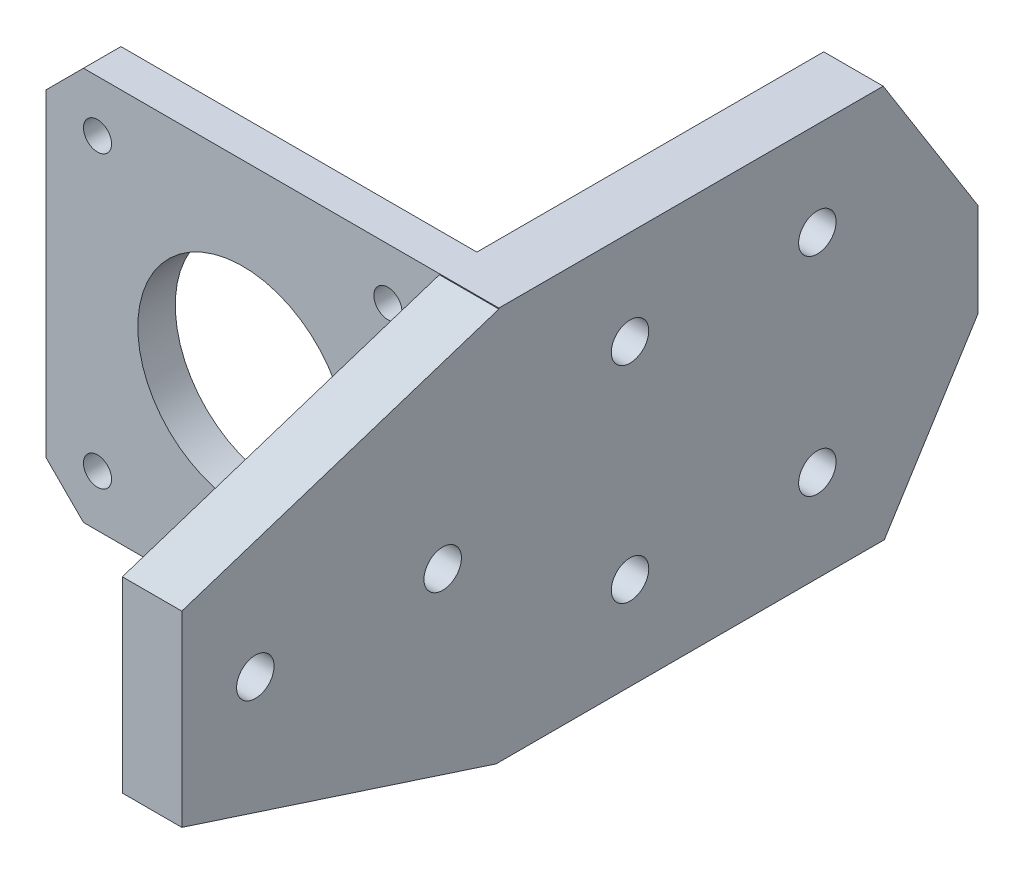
ISO-10303-21;
HEADER;
FILE_DESCRIPTION(('STEP AP214'),'2;1');
FILE_NAME('part.step','',(''),(''),'','','');
FILE_SCHEMA(('AUTOMOTIVE_DESIGN { 1 0 10303 214 1 1 1 1 }'));
ENDSEC;
DATA;
#1=APPLICATION_CONTEXT('core data for automotive mechanical design processes');
#2=APPLICATION_PROTOCOL_DEFINITION('international standard','automotive_design',2000,#1);
#3=PRODUCT_CONTEXT('',#1,'mechanical');
#4=PRODUCT('Part','Part','',(#3));
#5=PRODUCT_RELATED_PRODUCT_CATEGORY('part','',(#4));
#6=PRODUCT_DEFINITION_FORMATION('','',#4);
#7=PRODUCT_DEFINITION_CONTEXT('part definition',#1,'design');
#8=PRODUCT_DEFINITION('design','',#6,#7);
#9=PRODUCT_DEFINITION_SHAPE('','',#8);
#10=(LENGTH_UNIT() NAMED_UNIT(*) SI_UNIT(.MILLI.,.METRE.));
#11=(NAMED_UNIT(*) PLANE_ANGLE_UNIT() SI_UNIT($,.RADIAN.));
#12=(NAMED_UNIT(*) SI_UNIT($,.STERADIAN.) SOLID_ANGLE_UNIT());
#13=UNCERTAINTY_MEASURE_WITH_UNIT(LENGTH_MEASURE(1.E-05),#10,'distance_accuracy_value','');
#14=(GEOMETRIC_REPRESENTATION_CONTEXT(3) GLOBAL_UNCERTAINTY_ASSIGNED_CONTEXT((#13)) GLOBAL_UNIT_ASSIGNED_CONTEXT((#10,
#11,#12)) REPRESENTATION_CONTEXT('',''));
#15=CARTESIAN_POINT('',(0.,0.,0.));
#16=DIRECTION('',(0.,0.,1.));
#17=DIRECTION('',(1.,0.,0.));
#18=AXIS2_PLACEMENT_3D('',#15,#16,#17);
#19=CARTESIAN_POINT('',(0.,0.,37.85));
#20=DIRECTION('',(1.,0.,0.));
#21=DIRECTION('',(0.,0.,-1.));
#22=AXIS2_PLACEMENT_3D('',#19,#20,#21);
#23=PLANE('',#22);
#24=CARTESIAN_POINT('',(0.,31.9056700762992,-29.9999999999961));
#25=DIRECTION('',(-1.,0.,0.));
#26=DIRECTION('',(0.,0.,1.));
#27=AXIS2_PLACEMENT_3D('',#24,#25,#26);
#28=CIRCLE('',#27,2.00000000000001);
#29=CARTESIAN_POINT('',(0.,31.9528350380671,-31.9994437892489));
#30=VERTEX_POINT('',#29);
#31=CARTESIAN_POINT('',(0.,31.952835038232,-28.0005562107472));
#32=VERTEX_POINT('',#31);
#33=EDGE_CURVE('E175',#30,#32,#28,.T.);
#34=ORIENTED_EDGE('',*,*,#33,.T.);
#35=CARTESIAN_POINT('',(0.,32.,-30.));
#36=DIRECTION('',(-1.,0.,0.));
#37=DIRECTION('',(0.,0.,1.));
#38=AXIS2_PLACEMENT_3D('',#35,#36,#37);
#39=CIRCLE('',#38,2.00000000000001);
#40=EDGE_CURVE('E186',#30,#32,#39,.T.);
#41=ORIENTED_EDGE('',*,*,#40,.F.);
#42=EDGE_LOOP('',(#34,#41));
#43=FACE_BOUND('',#42,.T.);
#44=ADVANCED_FACE('F47',(#43),#23,.F.);
#45=CARTESIAN_POINT('',(0.,9.90567007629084,-29.9999999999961));
#46=DIRECTION('',(-1.,0.,0.));
#47=DIRECTION('',(0.,0.,1.));
#48=AXIS2_PLACEMENT_3D('',#45,#46,#47);
#49=CIRCLE('',#48,2.00000000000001);
#50=CARTESIAN_POINT('',(0.,9.85850511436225,-28.0005562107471));
#51=VERTEX_POINT('',#50);
#52=CARTESIAN_POINT('',(0.,9.85850511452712,-31.999443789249));
#53=VERTEX_POINT('',#52);
#54=EDGE_CURVE('E419',#51,#53,#49,.T.);
#55=ORIENTED_EDGE('',*,*,#54,.T.);
#56=CARTESIAN_POINT('',(0.,9.81134015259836,-30.));
#57=DIRECTION('',(-1.,0.,0.));
#58=DIRECTION('',(0.,0.,1.));
#59=AXIS2_PLACEMENT_3D('',#56,#57,#58);
#60=CIRCLE('',#59,2.00000000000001);
#61=EDGE_CURVE('E193',#53,#51,#60,.F.);
#62=ORIENTED_EDGE('',*,*,#61,.T.);
#63=EDGE_LOOP('',(#55,#62));
#64=FACE_BOUND('',#63,.T.);
#65=ADVANCED_FACE('F418',(#64),#23,.F.);
#66=CARTESIAN_POINT('',(85.,9.81134015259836,-30.));
#67=DIRECTION('',(-1.,0.,0.));
#68=DIRECTION('',(0.,0.,1.));
#69=AXIS2_PLACEMENT_3D('',#66,#67,#68);
#70=CYLINDRICAL_SURFACE('',#69,2.00000000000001);
#71=CARTESIAN_POINT('',(6.34999999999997,9.81134015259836,-30.));
#72=DIRECTION('',(1.,0.,0.));
#73=DIRECTION('',(0.,0.,-1.));
#74=AXIS2_PLACEMENT_3D('',#71,#72,#73);
#75=CIRCLE('',#74,2.00000000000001);
#76=CARTESIAN_POINT('',(6.34999999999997,9.81134015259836,-32.));
#77=VERTEX_POINT('',#76);
#78=EDGE_CURVE('E222',#77,#77,#75,.F.);
#79=ORIENTED_EDGE('',*,*,#78,.F.);
#80=EDGE_LOOP('',(#79));
#81=FACE_BOUND('',#80,.T.);
#82=ORIENTED_EDGE('',*,*,#61,.F.);
#83=DIRECTION('',(-1.,0.,0.));
#84=VECTOR('',#83,1.);
#85=CARTESIAN_POINT('',(1.25,9.85850511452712,-31.999443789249));
#86=LINE('',#85,#84);
#87=CARTESIAN_POINT('',(2.5,9.85850511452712,-31.999443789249));
#88=VERTEX_POINT('',#87);
#89=EDGE_CURVE('E11',#53,#88,#86,.F.);
#90=ORIENTED_EDGE('',*,*,#89,.T.);
#91=CARTESIAN_POINT('',(2.5,9.81134015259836,-30.));
#92=DIRECTION('',(-1.,0.,0.));
#93=DIRECTION('',(0.,0.,1.));
#94=AXIS2_PLACEMENT_3D('',#91,#92,#93);
#95=CIRCLE('',#94,2.00000000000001);
#96=CARTESIAN_POINT('',(2.5,9.85850511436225,-28.0005562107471));
#97=VERTEX_POINT('',#96);
#98=EDGE_CURVE('E181',#88,#97,#95,.T.);
#99=ORIENTED_EDGE('',*,*,#98,.T.);
#100=DIRECTION('',(-1.,0.,0.));
#101=VECTOR('',#100,1.);
#102=CARTESIAN_POINT('',(1.25,9.85850511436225,-28.0005562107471));
#103=LINE('',#102,#101);
#104=EDGE_CURVE('E56',#97,#51,#103,.T.);
#105=ORIENTED_EDGE('',*,*,#104,.T.);
#106=EDGE_LOOP('',(#82,#90,#99,#105));
#107=FACE_BOUND('',#106,.T.);
#108=ADVANCED_FACE('F414',(#81,#107),#70,.F.);
#109=CARTESIAN_POINT('',(85.,32.,-30.));
#110=DIRECTION('',(-1.,0.,0.));
#111=DIRECTION('',(0.,0.,1.));
#112=AXIS2_PLACEMENT_3D('',#109,#110,#111);
#113=CYLINDRICAL_SURFACE('',#112,2.00000000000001);
#114=CARTESIAN_POINT('',(6.34999999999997,32.,-30.));
#115=DIRECTION('',(1.,0.,0.));
#116=DIRECTION('',(0.,0.,-1.));
#117=AXIS2_PLACEMENT_3D('',#114,#115,#116);
#118=CIRCLE('',#117,2.00000000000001);
#119=CARTESIAN_POINT('',(6.34999999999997,32.,-32.));
#120=VERTEX_POINT('',#119);
#121=EDGE_CURVE('E374',#120,#120,#118,.T.);
#122=ORIENTED_EDGE('',*,*,#121,.T.);
#123=EDGE_LOOP('',(#122));
#124=FACE_BOUND('',#123,.T.);
#125=DIRECTION('',(-1.,0.,0.));
#126=VECTOR('',#125,1.);
#127=CARTESIAN_POINT('',(1.25,31.952835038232,-28.0005562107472));
#128=LINE('',#127,#126);
#129=CARTESIAN_POINT('',(2.5,31.952835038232,-28.0005562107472));
#130=VERTEX_POINT('',#129);
#131=EDGE_CURVE('E172',#130,#32,#128,.T.);
#132=ORIENTED_EDGE('',*,*,#131,.F.);
#133=CARTESIAN_POINT('',(2.5,32.,-30.));
#134=DIRECTION('',(-1.,0.,0.));
#135=DIRECTION('',(0.,0.,1.));
#136=AXIS2_PLACEMENT_3D('',#133,#134,#135);
#137=CIRCLE('',#136,2.00000000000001);
#138=CARTESIAN_POINT('',(2.5,31.9528350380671,-31.9994437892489));
#139=VERTEX_POINT('',#138);
#140=EDGE_CURVE('E396',#139,#130,#137,.F.);
#141=ORIENTED_EDGE('',*,*,#140,.F.);
#142=DIRECTION('',(-1.,0.,0.));
#143=VECTOR('',#142,1.);
#144=CARTESIAN_POINT('',(1.25,31.9528350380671,-31.9994437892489));
#145=LINE('',#144,#143);
#146=EDGE_CURVE('E182',#30,#139,#145,.F.);
#147=ORIENTED_EDGE('',*,*,#146,.F.);
#148=ORIENTED_EDGE('',*,*,#40,.T.);
#149=EDGE_LOOP('',(#132,#141,#147,#148));
#150=FACE_BOUND('',#149,.T.);
#151=ADVANCED_FACE('F191',(#124,#150),#113,.F.);
#152=CARTESIAN_POINT('',(85.,31.9056700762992,-9.99999999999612));
#153=DIRECTION('',(-1.,0.,0.));
#154=DIRECTION('',(0.,0.,1.));
#155=AXIS2_PLACEMENT_3D('',#152,#153,#154);
#156=CYLINDRICAL_SURFACE('',#155,2.000000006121);
#157=CARTESIAN_POINT('',(6.34999999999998,31.9056700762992,-9.99999999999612));
#158=DIRECTION('',(1.,0.,0.));
#159=DIRECTION('',(0.,0.,-1.));
#160=AXIS2_PLACEMENT_3D('',#157,#158,#159);
#161=CIRCLE('',#160,2.000000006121);
#162=CARTESIAN_POINT('',(6.34999999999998,31.9056700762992,-12.0000000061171));
#163=VERTEX_POINT('',#162);
#164=EDGE_CURVE('E378',#163,#163,#161,.T.);
#165=ORIENTED_EDGE('',*,*,#164,.T.);
#166=EDGE_LOOP('',(#165));
#167=FACE_BOUND('',#166,.T.);
#168=CARTESIAN_POINT('',(2.5,31.9056700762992,-9.99999999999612));
#169=DIRECTION('',(-1.,0.,0.));
#170=DIRECTION('',(0.,0.,1.));
#171=AXIS2_PLACEMENT_3D('',#168,#169,#170);
#172=CIRCLE('',#171,2.);
#173=CARTESIAN_POINT('',(2.5,31.9056700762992,-7.99999999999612));
#174=VERTEX_POINT('',#173);
#175=EDGE_CURVE('E452',#174,#174,#172,.T.);
#176=ORIENTED_EDGE('',*,*,#175,.T.);
#177=EDGE_LOOP('',(#176));
#178=FACE_BOUND('',#177,.T.);
#179=ADVANCED_FACE('F678',(#167,#178),#156,.F.);
#180=CARTESIAN_POINT('',(85.,9.90567007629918,-9.99999999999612));
#181=DIRECTION('',(-1.,0.,0.));
#182=DIRECTION('',(0.,0.,1.));
#183=AXIS2_PLACEMENT_3D('',#180,#181,#182);
#184=CYLINDRICAL_SURFACE('',#183,2.000000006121);
#185=CARTESIAN_POINT('',(6.34999999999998,9.90567007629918,-9.99999999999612));
#186=DIRECTION('',(1.,0.,0.));
#187=DIRECTION('',(0.,0.,-1.));
#188=AXIS2_PLACEMENT_3D('',#185,#186,#187);
#189=CIRCLE('',#188,2.000000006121);
#190=CARTESIAN_POINT('',(6.34999999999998,9.90567007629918,-12.0000000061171));
#191=VERTEX_POINT('',#190);
#192=EDGE_CURVE('E382',#191,#191,#189,.F.);
#193=ORIENTED_EDGE('',*,*,#192,.F.);
#194=EDGE_LOOP('',(#193));
#195=FACE_BOUND('',#194,.T.);
#196=CARTESIAN_POINT('',(2.5,9.90567007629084,-9.99999999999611));
#197=DIRECTION('',(-1.,0.,0.));
#198=DIRECTION('',(0.,0.,1.));
#199=AXIS2_PLACEMENT_3D('',#196,#197,#198);
#200=CIRCLE('',#199,2.);
#201=CARTESIAN_POINT('',(2.5,9.90567007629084,-7.99999999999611));
#202=VERTEX_POINT('',#201);
#203=EDGE_CURVE('E428',#202,#202,#200,.T.);
#204=ORIENTED_EDGE('',*,*,#203,.T.);
#205=EDGE_LOOP('',(#204));
#206=FACE_BOUND('',#205,.T.);
#207=ADVANCED_FACE('F682',(#195,#206),#184,.F.);
#208=CARTESIAN_POINT('',(85.,20.905670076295,10.0000000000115));
#209=DIRECTION('',(-1.,0.,0.));
#210=DIRECTION('',(0.,0.,1.));
#211=AXIS2_PLACEMENT_3D('',#208,#209,#210);
#212=CYLINDRICAL_SURFACE('',#211,2.);
#213=CARTESIAN_POINT('',(6.34999999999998,20.905670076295,10.0000000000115));
#214=DIRECTION('',(1.,0.,0.));
#215=DIRECTION('',(0.,0.,-1.));
#216=AXIS2_PLACEMENT_3D('',#213,#214,#215);
#217=CIRCLE('',#216,2.);
#218=CARTESIAN_POINT('',(6.34999999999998,20.905670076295,8.00000000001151));
#219=VERTEX_POINT('',#218);
#220=EDGE_CURVE('E386',#219,#219,#217,.T.);
#221=ORIENTED_EDGE('',*,*,#220,.T.);
#222=EDGE_LOOP('',(#221));
#223=FACE_BOUND('',#222,.T.);
#224=CARTESIAN_POINT('',(2.5,20.905670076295,10.0000000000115));
#225=DIRECTION('',(-1.,0.,0.));
#226=DIRECTION('',(0.,0.,1.));
#227=AXIS2_PLACEMENT_3D('',#224,#225,#226);
#228=CIRCLE('',#227,2.);
#229=CARTESIAN_POINT('',(2.5,20.905670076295,12.0000000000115));
#230=VERTEX_POINT('',#229);
#231=EDGE_CURVE('E468',#230,#230,#228,.F.);
#232=ORIENTED_EDGE('',*,*,#231,.F.);
#233=EDGE_LOOP('',(#232));
#234=FACE_BOUND('',#233,.T.);
#235=ADVANCED_FACE('F668',(#223,#234),#212,.F.);
#236=CARTESIAN_POINT('',(85.,20.905670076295,30.0000000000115));
#237=DIRECTION('',(-1.,0.,0.));
#238=DIRECTION('',(0.,0.,1.));
#239=AXIS2_PLACEMENT_3D('',#236,#237,#238);
#240=CYLINDRICAL_SURFACE('',#239,2.);
#241=CARTESIAN_POINT('',(6.34999999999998,20.905670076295,30.0000000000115));
#242=DIRECTION('',(1.,0.,0.));
#243=DIRECTION('',(0.,0.,-1.));
#244=AXIS2_PLACEMENT_3D('',#241,#242,#243);
#245=CIRCLE('',#244,2.);
#246=CARTESIAN_POINT('',(6.34999999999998,20.905670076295,28.0000000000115));
#247=VERTEX_POINT('',#246);
#248=EDGE_CURVE('E237',#247,#247,#245,.T.);
#249=ORIENTED_EDGE('',*,*,#248,.T.);
#250=EDGE_LOOP('',(#249));
#251=FACE_BOUND('',#250,.T.);
#252=CARTESIAN_POINT('',(2.5,20.905670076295,30.0000000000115));
#253=DIRECTION('',(-1.,0.,0.));
#254=DIRECTION('',(0.,0.,1.));
#255=AXIS2_PLACEMENT_3D('',#252,#253,#254);
#256=CIRCLE('',#255,2.);
#257=CARTESIAN_POINT('',(2.5,20.905670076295,32.0000000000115));
#258=VERTEX_POINT('',#257);
#259=EDGE_CURVE('E397',#258,#258,#256,.F.);
#260=ORIENTED_EDGE('',*,*,#259,.F.);
#261=EDGE_LOOP('',(#260));
#262=FACE_BOUND('',#261,.T.);
#263=ADVANCED_FACE('F640',(#251,#262),#240,.F.);
#264=CARTESIAN_POINT('',(0.,0.,4.));
#265=DIRECTION('',(0.,1.,0.));
#266=DIRECTION('',(0.,0.,1.));
#267=AXIS2_PLACEMENT_3D('',#264,#265,#266);
#268=PLANE('',#267);
#269=DIRECTION('',(-1.,0.,0.));
#270=VECTOR('',#269,1.);
#271=CARTESIAN_POINT('',(85.,0.,4.29027890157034));
#272=LINE('',#271,#270);
#273=CARTESIAN_POINT('',(6.34999999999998,0.,4.29027890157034));
#274=VERTEX_POINT('',#273);
#275=CARTESIAN_POINT('',(0.,0.,4.29027890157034));
#276=VERTEX_POINT('',#275);
#277=EDGE_CURVE('E203',#274,#276,#272,.T.);
#278=ORIENTED_EDGE('',*,*,#277,.T.);
#279=DIRECTION('',(0.,0.,-1.));
#280=VECTOR('',#279,1.);
#281=CARTESIAN_POINT('',(0.,0.,37.85));
#282=LINE('',#281,#280);
#283=CARTESIAN_POINT('',(0.,0.,4.));
#284=VERTEX_POINT('',#283);
#285=EDGE_CURVE('E246',#276,#284,#282,.T.);
#286=ORIENTED_EDGE('',*,*,#285,.T.);
#287=DIRECTION('',(1.,0.,0.));
#288=VECTOR('',#287,1.);
#289=CARTESIAN_POINT('',(0.,0.,4.));
#290=LINE('',#289,#288);
#291=CARTESIAN_POINT('',(-38.,0.,4.));
#292=VERTEX_POINT('',#291);
#293=EDGE_CURVE('E297',#292,#284,#290,.T.);
#294=ORIENTED_EDGE('',*,*,#293,.F.);
#295=DIRECTION('',(0.,0.,-1.));
#296=VECTOR('',#295,1.);
#297=CARTESIAN_POINT('',(-38.,0.,4.));
#298=LINE('',#297,#296);
#299=CARTESIAN_POINT('',(-38.,0.,0.));
#300=VERTEX_POINT('',#299);
#301=EDGE_CURVE('E301',#292,#300,#298,.T.);
#302=ORIENTED_EDGE('',*,*,#301,.T.);
#303=DIRECTION('',(1.,0.,0.));
#304=VECTOR('',#303,1.);
#305=CARTESIAN_POINT('',(0.,0.,0.));
#306=LINE('',#305,#304);
#307=CARTESIAN_POINT('',(0.,0.,0.));
#308=VERTEX_POINT('',#307);
#309=EDGE_CURVE('E262',#300,#308,#306,.T.);
#310=ORIENTED_EDGE('',*,*,#309,.T.);
#311=CARTESIAN_POINT('',(0.,0.,-37.15));
#312=VERTEX_POINT('',#311);
#313=EDGE_CURVE('E249',#308,#312,#282,.T.);
#314=ORIENTED_EDGE('',*,*,#313,.T.);
#315=DIRECTION('',(-1.,0.,0.));
#316=VECTOR('',#315,1.);
#317=CARTESIAN_POINT('',(85.,0.,-37.15));
#318=LINE('',#317,#316);
#319=CARTESIAN_POINT('',(6.34999999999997,0.,-37.15));
#320=VERTEX_POINT('',#319);
#321=EDGE_CURVE('E401',#320,#312,#318,.T.);
#322=ORIENTED_EDGE('',*,*,#321,.F.);
#323=DIRECTION('',(0.,0.,-1.));
#324=VECTOR('',#323,1.);
#325=CARTESIAN_POINT('',(6.34999999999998,0.,37.85));
#326=LINE('',#325,#324);
#327=EDGE_CURVE('E250',#274,#320,#326,.T.);
#328=ORIENTED_EDGE('',*,*,#327,.F.);
#329=EDGE_LOOP('',(#278,#286,#294,#302,#310,#314,#322,#328));
#330=FACE_BOUND('',#329,.T.);
#331=ADVANCED_FACE('F521',(#330),#268,.F.);
#332=CARTESIAN_POINT('',(0.,20.905670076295,30.0000000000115));
#333=DIRECTION('',(-1.,0.,0.));
#334=DIRECTION('',(0.,0.,1.));
#335=AXIS2_PLACEMENT_3D('',#332,#333,#334);
#336=CIRCLE('',#335,4.7999999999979);
#337=CARTESIAN_POINT('',(0.,20.905670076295,34.8000000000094));
#338=VERTEX_POINT('',#337);
#339=EDGE_CURVE('E457',#338,#338,#336,.T.);
#340=ORIENTED_EDGE('',*,*,#339,.F.);
#341=EDGE_LOOP('',(#340));
#342=FACE_BOUND('',#341,.T.);
#343=CARTESIAN_POINT('',(0.,20.905670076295,10.0000000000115));
#344=DIRECTION('',(-1.,0.,0.));
#345=DIRECTION('',(0.,0.,1.));
#346=AXIS2_PLACEMENT_3D('',#343,#344,#345);
#347=CIRCLE('',#346,4.8);
#348=CARTESIAN_POINT('',(0.,20.905670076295,14.8000000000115));
#349=VERTEX_POINT('',#348);
#350=EDGE_CURVE('E472',#349,#349,#347,.T.);
#351=ORIENTED_EDGE('',*,*,#350,.F.);
#352=EDGE_LOOP('',(#351));
#353=FACE_BOUND('',#352,.T.);
#354=DIRECTION('',(0.,-1.,0.));
#355=VECTOR('',#354,1.);
#356=CARTESIAN_POINT('',(0.,0.,37.85));
#357=LINE('',#356,#355);
#358=CARTESIAN_POINT('',(0.,30.905670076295,37.85));
#359=VERTEX_POINT('',#358);
#360=CARTESIAN_POINT('',(0.,10.905670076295,37.85));
#361=VERTEX_POINT('',#360);
#362=EDGE_CURVE('E227',#359,#361,#357,.T.);
#363=ORIENTED_EDGE('',*,*,#362,.F.);
#364=DIRECTION('',(0.,-0.309054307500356,0.951044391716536));
#365=VECTOR('',#364,1.);
#366=CARTESIAN_POINT('',(0.,39.0787656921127,12.6991557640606));
#367=LINE('',#366,#365);
#368=CARTESIAN_POINT('',(0.,41.9056700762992,4.));
#369=VERTEX_POINT('',#368);
#370=EDGE_CURVE('E489',#369,#359,#367,.T.);
#371=ORIENTED_EDGE('',*,*,#370,.F.);
#372=DIRECTION('',(0.,-1.,0.));
#373=VECTOR('',#372,1.);
#374=CARTESIAN_POINT('',(0.,0.,4.));
#375=LINE('',#374,#373);
#376=EDGE_CURVE('E278',#369,#284,#375,.T.);
#377=ORIENTED_EDGE('',*,*,#376,.T.);
#378=ORIENTED_EDGE('',*,*,#285,.F.);
#379=DIRECTION('',(0.,0.309054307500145,0.951044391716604));
#380=VECTOR('',#379,1.);
#381=CARTESIAN_POINT('',(0.,-1.26101750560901,0.409784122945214));
#382=LINE('',#381,#380);
#383=EDGE_CURVE('E194',#276,#361,#382,.T.);
#384=ORIENTED_EDGE('',*,*,#383,.T.);
#385=EDGE_LOOP('',(#363,#371,#377,#378,#384));
#386=FACE_BOUND('',#385,.T.);
#387=ADVANCED_FACE('F607',(#342,#353,#386),#23,.F.);
#388=CARTESIAN_POINT('',(0.,31.9056700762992,-9.99999999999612));
#389=DIRECTION('',(-1.,0.,0.));
#390=DIRECTION('',(0.,0.,1.));
#391=AXIS2_PLACEMENT_3D('',#388,#389,#390);
#392=CIRCLE('',#391,4.8);
#393=CARTESIAN_POINT('',(0.,31.9056700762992,-5.19999999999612));
#394=VERTEX_POINT('',#393);
#395=EDGE_CURVE('E446',#394,#394,#392,.T.);
#396=ORIENTED_EDGE('',*,*,#395,.F.);
#397=EDGE_LOOP('',(#396));
#398=FACE_BOUND('',#397,.T.);
#399=CARTESIAN_POINT('',(0.,31.9056700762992,-29.9999999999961));
#400=DIRECTION('',(-1.,0.,0.));
#401=DIRECTION('',(0.,0.,1.));
#402=AXIS2_PLACEMENT_3D('',#399,#400,#401);
#403=CIRCLE('',#402,4.8);
#404=CARTESIAN_POINT('',(0.,31.9056700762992,-25.1999999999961));
#405=VERTEX_POINT('',#404);
#406=EDGE_CURVE('E189',#405,#405,#403,.T.);
#407=ORIENTED_EDGE('',*,*,#406,.F.);
#408=EDGE_LOOP('',(#407));
#409=FACE_BOUND('',#408,.T.);
#410=CARTESIAN_POINT('',(0.,9.90567007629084,-29.9999999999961));
#411=DIRECTION('',(-1.,0.,0.));
#412=DIRECTION('',(0.,0.,1.));
#413=AXIS2_PLACEMENT_3D('',#410,#411,#412);
#414=CIRCLE('',#413,4.8);
#415=CARTESIAN_POINT('',(0.,9.90567007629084,-25.1999999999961));
#416=VERTEX_POINT('',#415);
#417=EDGE_CURVE('E422',#416,#416,#414,.T.);
#418=ORIENTED_EDGE('',*,*,#417,.F.);
#419=EDGE_LOOP('',(#418));
#420=FACE_BOUND('',#419,.T.);
#421=CARTESIAN_POINT('',(0.,9.90567007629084,-9.99999999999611));
#422=DIRECTION('',(-1.,0.,0.));
#423=DIRECTION('',(0.,0.,1.));
#424=AXIS2_PLACEMENT_3D('',#421,#422,#423);
#425=CIRCLE('',#424,4.8);
#426=CARTESIAN_POINT('',(0.,9.90567007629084,-5.19999999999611));
#427=VERTEX_POINT('',#426);
#428=EDGE_CURVE('E479',#427,#427,#425,.T.);
#429=ORIENTED_EDGE('',*,*,#428,.F.);
#430=EDGE_LOOP('',(#429));
#431=FACE_BOUND('',#430,.T.);
#432=DIRECTION('',(0.,0.,-1.));
#433=VECTOR('',#432,1.);
#434=CARTESIAN_POINT('',(0.,42.,37.85));
#435=LINE('',#434,#433);
#436=CARTESIAN_POINT('',(0.,42.,0.));
#437=VERTEX_POINT('',#436);
#438=CARTESIAN_POINT('',(0.,42.,-37.0313883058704));
#439=VERTEX_POINT('',#438);
#440=EDGE_CURVE('E241',#437,#439,#435,.T.);
#441=ORIENTED_EDGE('',*,*,#440,.T.);
#442=DIRECTION('',(0.,0.846584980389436,0.532253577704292));
#443=VECTOR('',#442,1.);
#444=CARTESIAN_POINT('',(0.,28.5846078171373,-45.465734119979));
#445=LINE('',#444,#443);
#446=CARTESIAN_POINT('',(0.,25.9056700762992,-47.15));
#447=VERTEX_POINT('',#446);
#448=EDGE_CURVE('E206',#447,#439,#445,.T.);
#449=ORIENTED_EDGE('',*,*,#448,.F.);
#450=DIRECTION('',(0.,-1.,0.));
#451=VECTOR('',#450,1.);
#452=CARTESIAN_POINT('',(0.,0.,-47.15));
#453=LINE('',#452,#451);
#454=CARTESIAN_POINT('',(0.,15.9056700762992,-47.15));
#455=VERTEX_POINT('',#454);
#456=EDGE_CURVE('E228',#447,#455,#453,.T.);
#457=ORIENTED_EDGE('',*,*,#456,.T.);
#458=DIRECTION('',(0.,-0.846584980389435,0.532253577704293));
#459=VECTOR('',#458,1.);
#460=CARTESIAN_POINT('',(0.,-16.7397114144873,-26.6256326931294));
#461=LINE('',#460,#459);
#462=EDGE_CURVE('E482',#455,#312,#461,.T.);
#463=ORIENTED_EDGE('',*,*,#462,.T.);
#464=ORIENTED_EDGE('',*,*,#313,.F.);
#465=DIRECTION('',(0.,-1.,0.));
#466=VECTOR('',#465,1.);
#467=CARTESIAN_POINT('',(0.,0.,0.));
#468=LINE('',#467,#466);
#469=EDGE_CURVE('E321',#437,#308,#468,.T.);
#470=ORIENTED_EDGE('',*,*,#469,.F.);
#471=EDGE_LOOP('',(#441,#449,#457,#463,#464,#470));
#472=FACE_BOUND('',#471,.T.);
#473=ADVANCED_FACE('F509',(#398,#409,#420,#431,#472),#23,.F.);
#474=CARTESIAN_POINT('',(6.34999999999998,0.,37.85));
#475=DIRECTION('',(1.,0.,0.));
#476=DIRECTION('',(0.,0.,-1.));
#477=AXIS2_PLACEMENT_3D('',#474,#475,#476);
#478=PLANE('',#477);
#479=ORIENTED_EDGE('',*,*,#192,.T.);
#480=EDGE_LOOP('',(#479));
#481=FACE_BOUND('',#480,.T.);
#482=ORIENTED_EDGE('',*,*,#78,.T.);
#483=EDGE_LOOP('',(#482));
#484=FACE_BOUND('',#483,.T.);
#485=ORIENTED_EDGE('',*,*,#121,.F.);
#486=EDGE_LOOP('',(#485));
#487=FACE_BOUND('',#486,.T.);
#488=ORIENTED_EDGE('',*,*,#164,.F.);
#489=EDGE_LOOP('',(#488));
#490=FACE_BOUND('',#489,.T.);
#491=ORIENTED_EDGE('',*,*,#220,.F.);
#492=EDGE_LOOP('',(#491));
#493=FACE_BOUND('',#492,.T.);
#494=ORIENTED_EDGE('',*,*,#248,.F.);
#495=EDGE_LOOP('',(#494));
#496=FACE_BOUND('',#495,.T.);
#497=DIRECTION('',(0.,-0.846584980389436,-0.532253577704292));
#498=VECTOR('',#497,1.);
#499=CARTESIAN_POINT('',(6.34999999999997,45.6397377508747,-34.7430611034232));
#500=LINE('',#499,#498);
#501=CARTESIAN_POINT('',(6.34999999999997,42.,-37.0313883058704));
#502=VERTEX_POINT('',#501);
#503=CARTESIAN_POINT('',(6.34999999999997,25.9056700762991,-47.15));
#504=VERTEX_POINT('',#503);
#505=EDGE_CURVE('E212',#502,#504,#500,.T.);
#506=ORIENTED_EDGE('',*,*,#505,.F.);
#507=DIRECTION('',(0.,0.,-1.));
#508=VECTOR('',#507,1.);
#509=CARTESIAN_POINT('',(6.34999999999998,42.,37.85));
#510=LINE('',#509,#508);
#511=CARTESIAN_POINT('',(6.34999999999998,42.,4.));
#512=VERTEX_POINT('',#511);
#513=EDGE_CURVE('E232',#512,#502,#510,.T.);
#514=ORIENTED_EDGE('',*,*,#513,.F.);
#515=DIRECTION('',(0.,1.,0.));
#516=VECTOR('',#515,1.);
#517=CARTESIAN_POINT('',(6.34999999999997,0.,4.));
#518=LINE('',#517,#516);
#519=CARTESIAN_POINT('',(6.34999999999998,41.9056700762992,4.));
#520=VERTEX_POINT('',#519);
#521=EDGE_CURVE('E370',#520,#512,#518,.T.);
#522=ORIENTED_EDGE('',*,*,#521,.F.);
#523=DIRECTION('',(0.,0.309054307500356,-0.951044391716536));
#524=VECTOR('',#523,1.);
#525=CARTESIAN_POINT('',(6.34999999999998,27.9537284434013,46.9339294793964));
#526=LINE('',#525,#524);
#527=CARTESIAN_POINT('',(6.34999999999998,30.905670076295,37.85));
#528=VERTEX_POINT('',#527);
#529=EDGE_CURVE('E219',#528,#520,#526,.T.);
#530=ORIENTED_EDGE('',*,*,#529,.F.);
#531=DIRECTION('',(0.,-1.,0.));
#532=VECTOR('',#531,1.);
#533=CARTESIAN_POINT('',(6.34999999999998,0.,37.85));
#534=LINE('',#533,#532);
#535=CARTESIAN_POINT('',(6.34999999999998,10.9056700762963,37.85));
#536=VERTEX_POINT('',#535);
#537=EDGE_CURVE('E223',#528,#536,#534,.T.);
#538=ORIENTED_EDGE('',*,*,#537,.T.);
#539=DIRECTION('',(0.,-0.309054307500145,-0.951044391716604));
#540=VECTOR('',#539,1.);
#541=CARTESIAN_POINT('',(6.34999999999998,9.86401974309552,34.6445578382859));
#542=LINE('',#541,#540);
#543=EDGE_CURVE('E215',#536,#274,#542,.T.);
#544=ORIENTED_EDGE('',*,*,#543,.T.);
#545=ORIENTED_EDGE('',*,*,#327,.T.);
#546=DIRECTION('',(0.,0.846584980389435,-0.532253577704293));
#547=VECTOR('',#546,1.);
#548=CARTESIAN_POINT('',(6.34999999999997,-33.7948413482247,-15.9029596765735));
#549=LINE('',#548,#547);
#550=CARTESIAN_POINT('',(6.34999999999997,15.9056700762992,-47.15));
#551=VERTEX_POINT('',#550);
#552=EDGE_CURVE('E200',#320,#551,#549,.T.);
#553=ORIENTED_EDGE('',*,*,#552,.T.);
#554=DIRECTION('',(0.,-1.,0.));
#555=VECTOR('',#554,1.);
#556=CARTESIAN_POINT('',(6.34999999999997,0.,-47.15));
#557=LINE('',#556,#555);
#558=EDGE_CURVE('E233',#504,#551,#557,.T.);
#559=ORIENTED_EDGE('',*,*,#558,.F.);
#560=EDGE_LOOP('',(#506,#514,#522,#530,#538,#544,#545,#553,#559));
#561=FACE_BOUND('',#560,.T.);
#562=ADVANCED_FACE('F518',(#481,#484,#487,#490,#493,#496,#561),#478,.T.);
#563=CARTESIAN_POINT('',(0.,0.,37.85));
#564=DIRECTION('',(0.,0.,-1.));
#565=DIRECTION('',(-1.,0.,0.));
#566=AXIS2_PLACEMENT_3D('',#563,#564,#565);
#567=PLANE('',#566);
#568=ORIENTED_EDGE('',*,*,#537,.F.);
#569=DIRECTION('',(-1.,0.,0.));
#570=VECTOR('',#569,1.);
#571=CARTESIAN_POINT('',(0.,30.9056700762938,37.85));
#572=LINE('',#571,#570);
#573=EDGE_CURVE('E366',#528,#359,#572,.T.);
#574=ORIENTED_EDGE('',*,*,#573,.T.);
#575=ORIENTED_EDGE('',*,*,#362,.T.);
#576=DIRECTION('',(-1.,0.,0.));
#577=VECTOR('',#576,1.);
#578=CARTESIAN_POINT('',(0.,10.9056700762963,37.85));
#579=LINE('',#578,#577);
#580=EDGE_CURVE('E363',#536,#361,#579,.T.);
#581=ORIENTED_EDGE('',*,*,#580,.F.);
#582=EDGE_LOOP('',(#568,#574,#575,#581));
#583=FACE_BOUND('',#582,.T.);
#584=ADVANCED_FACE('F602',(#583),#567,.F.);
#585=CARTESIAN_POINT('',(0.,0.,-47.15));
#586=DIRECTION('',(0.,0.,-1.));
#587=DIRECTION('',(-1.,0.,0.));
#588=AXIS2_PLACEMENT_3D('',#585,#586,#587);
#589=PLANE('',#588);
#590=DIRECTION('',(-1.,0.,0.));
#591=VECTOR('',#590,1.);
#592=CARTESIAN_POINT('',(0.,25.9056700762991,-47.15));
#593=LINE('',#592,#591);
#594=EDGE_CURVE('E360',#504,#447,#593,.T.);
#595=ORIENTED_EDGE('',*,*,#594,.F.);
#596=ORIENTED_EDGE('',*,*,#558,.T.);
#597=DIRECTION('',(-1.,0.,0.));
#598=VECTOR('',#597,1.);
#599=CARTESIAN_POINT('',(0.,15.9056700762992,-47.15));
#600=LINE('',#599,#598);
#601=EDGE_CURVE('E356',#551,#455,#600,.T.);
#602=ORIENTED_EDGE('',*,*,#601,.T.);
#603=ORIENTED_EDGE('',*,*,#456,.F.);
#604=EDGE_LOOP('',(#595,#596,#602,#603));
#605=FACE_BOUND('',#604,.T.);
#606=ADVANCED_FACE('F512',(#605),#589,.T.);
#607=CARTESIAN_POINT('',(0.,42.,4.));
#608=DIRECTION('',(0.,1.,0.));
#609=DIRECTION('',(0.,0.,1.));
#610=AXIS2_PLACEMENT_3D('',#607,#608,#609);
#611=PLANE('',#610);
#612=DIRECTION('',(-1.,0.,0.));
#613=VECTOR('',#612,1.);
#614=CARTESIAN_POINT('',(85.,42.,-37.0313883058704));
#615=LINE('',#614,#613);
#616=EDGE_CURVE('E486',#502,#439,#615,.T.);
#617=ORIENTED_EDGE('',*,*,#616,.T.);
#618=ORIENTED_EDGE('',*,*,#440,.F.);
#619=DIRECTION('',(1.,0.,0.));
#620=VECTOR('',#619,1.);
#621=CARTESIAN_POINT('',(0.,42.,0.));
#622=LINE('',#621,#620);
#623=CARTESIAN_POINT('',(-38.,42.,0.));
#624=VERTEX_POINT('',#623);
#625=EDGE_CURVE('E325',#624,#437,#622,.T.);
#626=ORIENTED_EDGE('',*,*,#625,.F.);
#627=DIRECTION('',(0.,0.,-1.));
#628=VECTOR('',#627,1.);
#629=CARTESIAN_POINT('',(-38.,42.,4.));
#630=LINE('',#629,#628);
#631=CARTESIAN_POINT('',(-38.,42.,4.));
#632=VERTEX_POINT('',#631);
#633=EDGE_CURVE('E353',#632,#624,#630,.T.);
#634=ORIENTED_EDGE('',*,*,#633,.F.);
#635=DIRECTION('',(1.,0.,0.));
#636=VECTOR('',#635,1.);
#637=CARTESIAN_POINT('',(0.,42.,4.));
#638=LINE('',#637,#636);
#639=EDGE_CURVE('E282',#632,#512,#638,.T.);
#640=ORIENTED_EDGE('',*,*,#639,.T.);
#641=ORIENTED_EDGE('',*,*,#513,.T.);
#642=EDGE_LOOP('',(#617,#618,#626,#634,#640,#641));
#643=FACE_BOUND('',#642,.T.);
#644=ADVANCED_FACE('F583',(#643),#611,.T.);
#645=CARTESIAN_POINT('',(-40.,40.,4.));
#646=DIRECTION('',(0.707106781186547,-0.707106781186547,0.));
#647=DIRECTION('',(0.707106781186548,0.707106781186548,0.));
#648=AXIS2_PLACEMENT_3D('',#645,#646,#647);
#649=PLANE('',#648);
#650=DIRECTION('',(-0.707106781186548,-0.707106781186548,0.));
#651=VECTOR('',#650,1.);
#652=CARTESIAN_POINT('',(-40.,40.,0.));
#653=LINE('',#652,#651);
#654=CARTESIAN_POINT('',(-42.,38.,0.));
#655=VERTEX_POINT('',#654);
#656=EDGE_CURVE('E328',#624,#655,#653,.T.);
#657=ORIENTED_EDGE('',*,*,#656,.T.);
#658=DIRECTION('',(0.,0.,-1.));
#659=VECTOR('',#658,1.);
#660=CARTESIAN_POINT('',(-42.,38.,4.));
#661=LINE('',#660,#659);
#662=CARTESIAN_POINT('',(-42.,38.,4.));
#663=VERTEX_POINT('',#662);
#664=EDGE_CURVE('E349',#663,#655,#661,.T.);
#665=ORIENTED_EDGE('',*,*,#664,.F.);
#666=DIRECTION('',(-0.707106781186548,-0.707106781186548,0.));
#667=VECTOR('',#666,1.);
#668=CARTESIAN_POINT('',(-40.,40.,4.));
#669=LINE('',#668,#667);
#670=EDGE_CURVE('E285',#632,#663,#669,.T.);
#671=ORIENTED_EDGE('',*,*,#670,.F.);
#672=ORIENTED_EDGE('',*,*,#633,.T.);
#673=EDGE_LOOP('',(#657,#665,#671,#672));
#674=FACE_BOUND('',#673,.T.);
#675=ADVANCED_FACE('F589',(#674),#649,.F.);
#676=CARTESIAN_POINT('',(-42.,0.,4.));
#677=DIRECTION('',(1.,0.,0.));
#678=DIRECTION('',(0.,0.,-1.));
#679=AXIS2_PLACEMENT_3D('',#676,#677,#678);
#680=PLANE('',#679);
#681=DIRECTION('',(0.,-1.,0.));
#682=VECTOR('',#681,1.);
#683=CARTESIAN_POINT('',(-42.,0.,0.));
#684=LINE('',#683,#682);
#685=CARTESIAN_POINT('',(-42.,4.,0.));
#686=VERTEX_POINT('',#685);
#687=EDGE_CURVE('E332',#655,#686,#684,.T.);
#688=ORIENTED_EDGE('',*,*,#687,.T.);
#689=DIRECTION('',(0.,0.,-1.));
#690=VECTOR('',#689,1.);
#691=CARTESIAN_POINT('',(-42.,4.,4.));
#692=LINE('',#691,#690);
#693=CARTESIAN_POINT('',(-42.,4.,4.));
#694=VERTEX_POINT('',#693);
#695=EDGE_CURVE('E345',#694,#686,#692,.T.);
#696=ORIENTED_EDGE('',*,*,#695,.F.);
#697=DIRECTION('',(0.,-1.,0.));
#698=VECTOR('',#697,1.);
#699=CARTESIAN_POINT('',(-42.,0.,4.));
#700=LINE('',#699,#698);
#701=EDGE_CURVE('E289',#663,#694,#700,.T.);
#702=ORIENTED_EDGE('',*,*,#701,.F.);
#703=ORIENTED_EDGE('',*,*,#664,.T.);
#704=EDGE_LOOP('',(#688,#696,#702,#703));
#705=FACE_BOUND('',#704,.T.);
#706=ADVANCED_FACE('F614',(#705),#680,.F.);
#707=CARTESIAN_POINT('',(-19.,-19.,4.));
#708=DIRECTION('',(0.707106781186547,0.707106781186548,0.));
#709=DIRECTION('',(-0.707106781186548,0.707106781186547,0.));
#710=AXIS2_PLACEMENT_3D('',#707,#708,#709);
#711=PLANE('',#710);
#712=DIRECTION('',(0.707106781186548,-0.707106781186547,0.));
#713=VECTOR('',#712,1.);
#714=CARTESIAN_POINT('',(-19.,-19.,0.));
#715=LINE('',#714,#713);
#716=EDGE_CURVE('E336',#686,#300,#715,.T.);
#717=ORIENTED_EDGE('',*,*,#716,.T.);
#718=ORIENTED_EDGE('',*,*,#301,.F.);
#719=DIRECTION('',(0.707106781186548,-0.707106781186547,0.));
#720=VECTOR('',#719,1.);
#721=CARTESIAN_POINT('',(-19.,-19.,4.));
#722=LINE('',#721,#720);
#723=EDGE_CURVE('E293',#694,#292,#722,.T.);
#724=ORIENTED_EDGE('',*,*,#723,.F.);
#725=ORIENTED_EDGE('',*,*,#695,.T.);
#726=EDGE_LOOP('',(#717,#718,#724,#725));
#727=FACE_BOUND('',#726,.T.);
#728=ADVANCED_FACE('F612',(#727),#711,.F.);
#729=CARTESIAN_POINT('',(-36.4999999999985,36.4999999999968,4.));
#730=DIRECTION('',(0.,0.,-1.));
#731=DIRECTION('',(-1.,0.,0.));
#732=AXIS2_PLACEMENT_3D('',#729,#730,#731);
#733=CYLINDRICAL_SURFACE('',#732,1.5);
#734=CARTESIAN_POINT('',(-36.4999999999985,36.4999999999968,4.));
#735=DIRECTION('',(0.,0.,1.));
#736=DIRECTION('',(1.,0.,0.));
#737=AXIS2_PLACEMENT_3D('',#734,#735,#736);
#738=CIRCLE('',#737,1.5);
#739=CARTESIAN_POINT('',(-34.9999999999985,36.4999999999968,4.));
#740=VERTEX_POINT('',#739);
#741=EDGE_CURVE('E274',#740,#740,#738,.T.);
#742=ORIENTED_EDGE('',*,*,#741,.T.);
#743=EDGE_LOOP('',(#742));
#744=FACE_BOUND('',#743,.T.);
#745=CARTESIAN_POINT('',(-36.4999999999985,36.4999999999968,0.));
#746=DIRECTION('',(0.,0.,1.));
#747=DIRECTION('',(1.,0.,0.));
#748=AXIS2_PLACEMENT_3D('',#745,#746,#747);
#749=CIRCLE('',#748,1.5);
#750=CARTESIAN_POINT('',(-34.9999999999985,36.4999999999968,0.));
#751=VERTEX_POINT('',#750);
#752=EDGE_CURVE('E317',#751,#751,#749,.T.);
#753=ORIENTED_EDGE('',*,*,#752,.F.);
#754=EDGE_LOOP('',(#753));
#755=FACE_BOUND('',#754,.T.);
#756=ADVANCED_FACE('F621',(#744,#755),#733,.F.);
#757=CARTESIAN_POINT('',(-5.50000000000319,36.4999999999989,4.));
#758=DIRECTION('',(0.,0.,-1.));
#759=DIRECTION('',(-1.,0.,0.));
#760=AXIS2_PLACEMENT_3D('',#757,#758,#759);
#761=CYLINDRICAL_SURFACE('',#760,1.50000000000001);
#762=CARTESIAN_POINT('',(-5.50000000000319,36.4999999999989,4.));
#763=DIRECTION('',(0.,0.,1.));
#764=DIRECTION('',(1.,0.,0.));
#765=AXIS2_PLACEMENT_3D('',#762,#763,#764);
#766=CIRCLE('',#765,1.50000000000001);
#767=CARTESIAN_POINT('',(-4.00000000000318,36.4999999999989,4.));
#768=VERTEX_POINT('',#767);
#769=EDGE_CURVE('E270',#768,#768,#766,.T.);
#770=ORIENTED_EDGE('',*,*,#769,.T.);
#771=EDGE_LOOP('',(#770));
#772=FACE_BOUND('',#771,.T.);
#773=CARTESIAN_POINT('',(-5.50000000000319,36.4999999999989,0.));
#774=DIRECTION('',(0.,0.,1.));
#775=DIRECTION('',(1.,0.,0.));
#776=AXIS2_PLACEMENT_3D('',#773,#774,#775);
#777=CIRCLE('',#776,1.50000000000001);
#778=CARTESIAN_POINT('',(-4.00000000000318,36.4999999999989,0.));
#779=VERTEX_POINT('',#778);
#780=EDGE_CURVE('E313',#779,#779,#777,.T.);
#781=ORIENTED_EDGE('',*,*,#780,.F.);
#782=EDGE_LOOP('',(#781));
#783=FACE_BOUND('',#782,.T.);
#784=ADVANCED_FACE('F705',(#772,#783),#761,.F.);
#785=CARTESIAN_POINT('',(-5.50000000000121,5.50000000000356,4.));
#786=DIRECTION('',(0.,0.,-1.));
#787=DIRECTION('',(-1.,0.,0.));
#788=AXIS2_PLACEMENT_3D('',#785,#786,#787);
#789=CYLINDRICAL_SURFACE('',#788,1.5);
#790=CARTESIAN_POINT('',(-5.50000000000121,5.50000000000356,4.));
#791=DIRECTION('',(0.,0.,1.));
#792=DIRECTION('',(1.,0.,0.));
#793=AXIS2_PLACEMENT_3D('',#790,#791,#792);
#794=CIRCLE('',#793,1.5);
#795=CARTESIAN_POINT('',(-4.00000000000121,5.50000000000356,4.));
#796=VERTEX_POINT('',#795);
#797=EDGE_CURVE('E266',#796,#796,#794,.T.);
#798=ORIENTED_EDGE('',*,*,#797,.T.);
#799=EDGE_LOOP('',(#798));
#800=FACE_BOUND('',#799,.T.);
#801=CARTESIAN_POINT('',(-5.50000000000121,5.50000000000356,0.));
#802=DIRECTION('',(0.,0.,1.));
#803=DIRECTION('',(1.,0.,0.));
#804=AXIS2_PLACEMENT_3D('',#801,#802,#803);
#805=CIRCLE('',#804,1.5);
#806=CARTESIAN_POINT('',(-4.00000000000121,5.50000000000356,0.));
#807=VERTEX_POINT('',#806);
#808=EDGE_CURVE('E309',#807,#807,#805,.T.);
#809=ORIENTED_EDGE('',*,*,#808,.F.);
#810=EDGE_LOOP('',(#809));
#811=FACE_BOUND('',#810,.T.);
#812=ADVANCED_FACE('F709',(#800,#811),#789,.F.);
#813=CARTESIAN_POINT('',(-36.4999999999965,5.5000000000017,4.));
#814=DIRECTION('',(0.,0.,-1.));
#815=DIRECTION('',(-1.,0.,0.));
#816=AXIS2_PLACEMENT_3D('',#813,#814,#815);
#817=CYLINDRICAL_SURFACE('',#816,1.50000000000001);
#818=CARTESIAN_POINT('',(-36.4999999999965,5.5000000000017,4.));
#819=DIRECTION('',(0.,0.,1.));
#820=DIRECTION('',(1.,0.,0.));
#821=AXIS2_PLACEMENT_3D('',#818,#819,#820);
#822=CIRCLE('',#821,1.50000000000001);
#823=CARTESIAN_POINT('',(-34.9999999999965,5.5000000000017,4.));
#824=VERTEX_POINT('',#823);
#825=EDGE_CURVE('E261',#824,#824,#822,.T.);
#826=ORIENTED_EDGE('',*,*,#825,.T.);
#827=EDGE_LOOP('',(#826));
#828=FACE_BOUND('',#827,.T.);
#829=CARTESIAN_POINT('',(-36.4999999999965,5.5000000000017,0.));
#830=DIRECTION('',(0.,0.,1.));
#831=DIRECTION('',(1.,0.,0.));
#832=AXIS2_PLACEMENT_3D('',#829,#830,#831);
#833=CIRCLE('',#832,1.50000000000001);
#834=CARTESIAN_POINT('',(-34.9999999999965,5.5000000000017,0.));
#835=VERTEX_POINT('',#834);
#836=EDGE_CURVE('E305',#835,#835,#833,.T.);
#837=ORIENTED_EDGE('',*,*,#836,.F.);
#838=EDGE_LOOP('',(#837));
#839=FACE_BOUND('',#838,.T.);
#840=ADVANCED_FACE('F712',(#828,#839),#817,.F.);
#841=CARTESIAN_POINT('',(-21.,21.,4.));
#842=DIRECTION('',(0.,0.,-1.));
#843=DIRECTION('',(-1.,0.,0.));
#844=AXIS2_PLACEMENT_3D('',#841,#842,#843);
#845=CYLINDRICAL_SURFACE('',#844,11.2);
#846=CARTESIAN_POINT('',(-21.,21.,4.));
#847=DIRECTION('',(0.,0.,1.));
#848=DIRECTION('',(1.,0.,0.));
#849=AXIS2_PLACEMENT_3D('',#846,#847,#848);
#850=CIRCLE('',#849,11.2);
#851=CARTESIAN_POINT('',(-9.8,21.,4.));
#852=VERTEX_POINT('',#851);
#853=EDGE_CURVE('E257',#852,#852,#850,.T.);
#854=ORIENTED_EDGE('',*,*,#853,.T.);
#855=EDGE_LOOP('',(#854));
#856=FACE_BOUND('',#855,.T.);
#857=CARTESIAN_POINT('',(-21.,21.,0.));
#858=DIRECTION('',(0.,0.,1.));
#859=DIRECTION('',(1.,0.,0.));
#860=AXIS2_PLACEMENT_3D('',#857,#858,#859);
#861=CIRCLE('',#860,11.2);
#862=CARTESIAN_POINT('',(-9.8,21.,0.));
#863=VERTEX_POINT('',#862);
#864=EDGE_CURVE('E245',#863,#863,#861,.T.);
#865=ORIENTED_EDGE('',*,*,#864,.F.);
#866=EDGE_LOOP('',(#865));
#867=FACE_BOUND('',#866,.T.);
#868=ADVANCED_FACE('F49',(#856,#867),#845,.F.);
#869=CARTESIAN_POINT('',(0.,0.,4.));
#870=DIRECTION('',(0.,0.,1.));
#871=DIRECTION('',(1.,0.,0.));
#872=AXIS2_PLACEMENT_3D('',#869,#870,#871);
#873=PLANE('',#872);
#874=ORIENTED_EDGE('',*,*,#853,.F.);
#875=EDGE_LOOP('',(#874));
#876=FACE_BOUND('',#875,.T.);
#877=ORIENTED_EDGE('',*,*,#825,.F.);
#878=EDGE_LOOP('',(#877));
#879=FACE_BOUND('',#878,.T.);
#880=ORIENTED_EDGE('',*,*,#797,.F.);
#881=EDGE_LOOP('',(#880));
#882=FACE_BOUND('',#881,.T.);
#883=ORIENTED_EDGE('',*,*,#769,.F.);
#884=EDGE_LOOP('',(#883));
#885=FACE_BOUND('',#884,.T.);
#886=ORIENTED_EDGE('',*,*,#741,.F.);
#887=EDGE_LOOP('',(#886));
#888=FACE_BOUND('',#887,.T.);
#889=ORIENTED_EDGE('',*,*,#376,.F.);
#890=DIRECTION('',(-1.,0.,0.));
#891=VECTOR('',#890,1.);
#892=CARTESIAN_POINT('',(85.,41.9056700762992,4.));
#893=LINE('',#892,#891);
#894=EDGE_CURVE('E491',#520,#369,#893,.T.);
#895=ORIENTED_EDGE('',*,*,#894,.F.);
#896=ORIENTED_EDGE('',*,*,#521,.T.);
#897=ORIENTED_EDGE('',*,*,#639,.F.);
#898=ORIENTED_EDGE('',*,*,#670,.T.);
#899=ORIENTED_EDGE('',*,*,#701,.T.);
#900=ORIENTED_EDGE('',*,*,#723,.T.);
#901=ORIENTED_EDGE('',*,*,#293,.T.);
#902=EDGE_LOOP('',(#889,#895,#896,#897,#898,#899,#900,#901));
#903=FACE_BOUND('',#902,.T.);
#904=ADVANCED_FACE('F593',(#876,#879,#882,#885,#888,#903),#873,.T.);
#905=CARTESIAN_POINT('',(0.,0.,0.));
#906=DIRECTION('',(0.,0.,1.));
#907=DIRECTION('',(1.,0.,0.));
#908=AXIS2_PLACEMENT_3D('',#905,#906,#907);
#909=PLANE('',#908);
#910=ORIENTED_EDGE('',*,*,#864,.T.);
#911=EDGE_LOOP('',(#910));
#912=FACE_BOUND('',#911,.T.);
#913=ORIENTED_EDGE('',*,*,#836,.T.);
#914=EDGE_LOOP('',(#913));
#915=FACE_BOUND('',#914,.T.);
#916=ORIENTED_EDGE('',*,*,#808,.T.);
#917=EDGE_LOOP('',(#916));
#918=FACE_BOUND('',#917,.T.);
#919=ORIENTED_EDGE('',*,*,#780,.T.);
#920=EDGE_LOOP('',(#919));
#921=FACE_BOUND('',#920,.T.);
#922=ORIENTED_EDGE('',*,*,#752,.T.);
#923=EDGE_LOOP('',(#922));
#924=FACE_BOUND('',#923,.T.);
#925=ORIENTED_EDGE('',*,*,#469,.T.);
#926=ORIENTED_EDGE('',*,*,#309,.F.);
#927=ORIENTED_EDGE('',*,*,#716,.F.);
#928=ORIENTED_EDGE('',*,*,#687,.F.);
#929=ORIENTED_EDGE('',*,*,#656,.F.);
#930=ORIENTED_EDGE('',*,*,#625,.T.);
#931=EDGE_LOOP('',(#925,#926,#927,#928,#929,#930));
#932=FACE_BOUND('',#931,.T.);
#933=ADVANCED_FACE('F586',(#912,#915,#918,#921,#924,#932),#909,.F.);
#934=CARTESIAN_POINT('',(85.,-16.7397114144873,-26.6256326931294));
#935=DIRECTION('',(0.,-0.532253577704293,-0.846584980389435));
#936=DIRECTION('',(0.,0.846584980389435,-0.532253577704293));
#937=AXIS2_PLACEMENT_3D('',#934,#935,#936);
#938=PLANE('',#937);
#939=ORIENTED_EDGE('',*,*,#321,.T.);
#940=ORIENTED_EDGE('',*,*,#462,.F.);
#941=ORIENTED_EDGE('',*,*,#601,.F.);
#942=ORIENTED_EDGE('',*,*,#552,.F.);
#943=EDGE_LOOP('',(#939,#940,#941,#942));
#944=FACE_BOUND('',#943,.T.);
#945=ADVANCED_FACE('F515',(#944),#938,.T.);
#946=CARTESIAN_POINT('',(85.,28.5846078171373,-45.465734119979));
#947=DIRECTION('',(0.,-0.532253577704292,0.846584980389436));
#948=DIRECTION('',(0.,-0.846584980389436,-0.532253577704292));
#949=AXIS2_PLACEMENT_3D('',#946,#947,#948);
#950=PLANE('',#949);
#951=ORIENTED_EDGE('',*,*,#505,.T.);
#952=ORIENTED_EDGE('',*,*,#594,.T.);
#953=ORIENTED_EDGE('',*,*,#448,.T.);
#954=ORIENTED_EDGE('',*,*,#616,.F.);
#955=EDGE_LOOP('',(#951,#952,#953,#954));
#956=FACE_BOUND('',#955,.T.);
#957=ADVANCED_FACE('F504',(#956),#950,.F.);
#958=CARTESIAN_POINT('',(85.,-1.26101750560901,0.409784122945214));
#959=DIRECTION('',(0.,-0.951044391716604,0.309054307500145));
#960=DIRECTION('',(0.,-0.309054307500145,-0.951044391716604));
#961=AXIS2_PLACEMENT_3D('',#958,#959,#960);
#962=PLANE('',#961);
#963=ORIENTED_EDGE('',*,*,#580,.T.);
#964=ORIENTED_EDGE('',*,*,#383,.F.);
#965=ORIENTED_EDGE('',*,*,#277,.F.);
#966=ORIENTED_EDGE('',*,*,#543,.F.);
#967=EDGE_LOOP('',(#963,#964,#965,#966));
#968=FACE_BOUND('',#967,.T.);
#969=ADVANCED_FACE('F605',(#968),#962,.T.);
#970=CARTESIAN_POINT('',(85.,39.0787656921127,12.6991557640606));
#971=DIRECTION('',(0.,-0.951044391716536,-0.309054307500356));
#972=DIRECTION('',(0.,0.309054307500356,-0.951044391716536));
#973=AXIS2_PLACEMENT_3D('',#970,#971,#972);
#974=PLANE('',#973);
#975=ORIENTED_EDGE('',*,*,#529,.T.);
#976=ORIENTED_EDGE('',*,*,#894,.T.);
#977=ORIENTED_EDGE('',*,*,#370,.T.);
#978=ORIENTED_EDGE('',*,*,#573,.F.);
#979=EDGE_LOOP('',(#975,#976,#977,#978));
#980=FACE_BOUND('',#979,.T.);
#981=ADVANCED_FACE('F672',(#980),#974,.F.);
#982=CARTESIAN_POINT('',(2.5,20.905670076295,30.0000000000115));
#983=DIRECTION('',(-1.,0.,0.));
#984=DIRECTION('',(0.,0.,1.));
#985=AXIS2_PLACEMENT_3D('',#982,#983,#984);
#986=PLANE('',#985);
#987=CARTESIAN_POINT('',(2.5,20.905670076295,30.0000000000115));
#988=DIRECTION('',(-1.,0.,0.));
#989=DIRECTION('',(0.,0.,1.));
#990=AXIS2_PLACEMENT_3D('',#987,#988,#989);
#991=CIRCLE('',#990,4.7999999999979);
#992=CARTESIAN_POINT('',(2.5,20.905670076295,34.8000000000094));
#993=VERTEX_POINT('',#992);
#994=EDGE_CURVE('E464',#993,#993,#991,.T.);
#995=ORIENTED_EDGE('',*,*,#994,.T.);
#996=EDGE_LOOP('',(#995));
#997=FACE_BOUND('',#996,.T.);
#998=ORIENTED_EDGE('',*,*,#259,.T.);
#999=EDGE_LOOP('',(#998));
#1000=FACE_BOUND('',#999,.T.);
#1001=ADVANCED_FACE('F659',(#997,#1000),#986,.T.);
#1002=CARTESIAN_POINT('',(2.5,20.905670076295,30.0000000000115));
#1003=DIRECTION('',(-1.,0.,0.));
#1004=DIRECTION('',(0.,0.,1.));
#1005=AXIS2_PLACEMENT_3D('',#1002,#1003,#1004);
#1006=CYLINDRICAL_SURFACE('',#1005,4.7999999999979);
#1007=ORIENTED_EDGE('',*,*,#994,.F.);
#1008=EDGE_LOOP('',(#1007));
#1009=FACE_BOUND('',#1008,.T.);
#1010=ORIENTED_EDGE('',*,*,#339,.T.);
#1011=EDGE_LOOP('',(#1010));
#1012=FACE_BOUND('',#1011,.T.);
#1013=ADVANCED_FACE('F649',(#1009,#1012),#1006,.F.);
#1014=CARTESIAN_POINT('',(2.5,20.905670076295,10.0000000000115));
#1015=DIRECTION('',(-1.,0.,0.));
#1016=DIRECTION('',(0.,0.,1.));
#1017=AXIS2_PLACEMENT_3D('',#1014,#1015,#1016);
#1018=CYLINDRICAL_SURFACE('',#1017,4.8);
#1019=CARTESIAN_POINT('',(2.5,20.905670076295,10.0000000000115));
#1020=DIRECTION('',(-1.,0.,0.));
#1021=DIRECTION('',(0.,0.,1.));
#1022=AXIS2_PLACEMENT_3D('',#1019,#1020,#1021);
#1023=CIRCLE('',#1022,4.8);
#1024=CARTESIAN_POINT('',(2.5,20.905670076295,14.8000000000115));
#1025=VERTEX_POINT('',#1024);
#1026=EDGE_CURVE('E402',#1025,#1025,#1023,.T.);
#1027=ORIENTED_EDGE('',*,*,#1026,.F.);
#1028=EDGE_LOOP('',(#1027));
#1029=FACE_BOUND('',#1028,.T.);
#1030=ORIENTED_EDGE('',*,*,#350,.T.);
#1031=EDGE_LOOP('',(#1030));
#1032=FACE_BOUND('',#1031,.T.);
#1033=ADVANCED_FACE('F646',(#1029,#1032),#1018,.F.);
#1034=CARTESIAN_POINT('',(2.5,0.,0.));
#1035=DIRECTION('',(-1.,0.,0.));
#1036=DIRECTION('',(0.,0.,1.));
#1037=AXIS2_PLACEMENT_3D('',#1034,#1035,#1036);
#1038=PLANE('',#1037);
#1039=ORIENTED_EDGE('',*,*,#231,.T.);
#1040=EDGE_LOOP('',(#1039));
#1041=FACE_BOUND('',#1040,.T.);
#1042=ORIENTED_EDGE('',*,*,#1026,.T.);
#1043=EDGE_LOOP('',(#1042));
#1044=FACE_BOUND('',#1043,.T.);
#1045=ADVANCED_FACE('F648',(#1041,#1044),#1038,.T.);
#1046=CARTESIAN_POINT('',(2.5,9.90567007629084,-9.99999999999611));
#1047=DIRECTION('',(-1.,0.,0.));
#1048=DIRECTION('',(0.,0.,1.));
#1049=AXIS2_PLACEMENT_3D('',#1046,#1047,#1048);
#1050=CYLINDRICAL_SURFACE('',#1049,4.8);
#1051=CARTESIAN_POINT('',(2.5,9.90567007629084,-9.99999999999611));
#1052=DIRECTION('',(-1.,0.,0.));
#1053=DIRECTION('',(0.,0.,1.));
#1054=AXIS2_PLACEMENT_3D('',#1051,#1052,#1053);
#1055=CIRCLE('',#1054,4.8);
#1056=CARTESIAN_POINT('',(2.5,9.90567007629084,-5.19999999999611));
#1057=VERTEX_POINT('',#1056);
#1058=EDGE_CURVE('E421',#1057,#1057,#1055,.T.);
#1059=ORIENTED_EDGE('',*,*,#1058,.F.);
#1060=EDGE_LOOP('',(#1059));
#1061=FACE_BOUND('',#1060,.T.);
#1062=ORIENTED_EDGE('',*,*,#428,.T.);
#1063=EDGE_LOOP('',(#1062));
#1064=FACE_BOUND('',#1063,.T.);
#1065=ADVANCED_FACE('F656',(#1061,#1064),#1050,.F.);
#1066=CARTESIAN_POINT('',(2.5,0.,0.));
#1067=DIRECTION('',(-1.,0.,0.));
#1068=DIRECTION('',(0.,0.,1.));
#1069=AXIS2_PLACEMENT_3D('',#1066,#1067,#1068);
#1070=PLANE('',#1069);
#1071=ORIENTED_EDGE('',*,*,#203,.F.);
#1072=EDGE_LOOP('',(#1071));
#1073=FACE_BOUND('',#1072,.T.);
#1074=ORIENTED_EDGE('',*,*,#1058,.T.);
#1075=EDGE_LOOP('',(#1074));
#1076=FACE_BOUND('',#1075,.T.);
#1077=ADVANCED_FACE('F770',(#1073,#1076),#1070,.T.);
#1078=CARTESIAN_POINT('',(2.5,31.9056700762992,-9.99999999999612));
#1079=DIRECTION('',(-1.,0.,0.));
#1080=DIRECTION('',(0.,0.,1.));
#1081=AXIS2_PLACEMENT_3D('',#1078,#1079,#1080);
#1082=CYLINDRICAL_SURFACE('',#1081,4.8);
#1083=CARTESIAN_POINT('',(2.5,31.9056700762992,-9.99999999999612));
#1084=DIRECTION('',(-1.,0.,0.));
#1085=DIRECTION('',(0.,0.,1.));
#1086=AXIS2_PLACEMENT_3D('',#1083,#1084,#1085);
#1087=CIRCLE('',#1086,4.8);
#1088=CARTESIAN_POINT('',(2.5,31.9056700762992,-5.19999999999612));
#1089=VERTEX_POINT('',#1088);
#1090=EDGE_CURVE('E453',#1089,#1089,#1087,.T.);
#1091=ORIENTED_EDGE('',*,*,#1090,.F.);
#1092=EDGE_LOOP('',(#1091));
#1093=FACE_BOUND('',#1092,.T.);
#1094=ORIENTED_EDGE('',*,*,#395,.T.);
#1095=EDGE_LOOP('',(#1094));
#1096=FACE_BOUND('',#1095,.T.);
#1097=ADVANCED_FACE('F766',(#1093,#1096),#1082,.F.);
#1098=CARTESIAN_POINT('',(2.5,0.,0.));
#1099=DIRECTION('',(-1.,0.,0.));
#1100=DIRECTION('',(0.,0.,1.));
#1101=AXIS2_PLACEMENT_3D('',#1098,#1099,#1100);
#1102=PLANE('',#1101);
#1103=ORIENTED_EDGE('',*,*,#175,.F.);
#1104=EDGE_LOOP('',(#1103));
#1105=FACE_BOUND('',#1104,.T.);
#1106=ORIENTED_EDGE('',*,*,#1090,.T.);
#1107=EDGE_LOOP('',(#1106));
#1108=FACE_BOUND('',#1107,.T.);
#1109=ADVANCED_FACE('F763',(#1105,#1108),#1102,.T.);
#1110=CARTESIAN_POINT('',(2.5,31.9056700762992,-29.9999999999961));
#1111=DIRECTION('',(-1.,0.,0.));
#1112=DIRECTION('',(0.,0.,1.));
#1113=AXIS2_PLACEMENT_3D('',#1110,#1111,#1112);
#1114=CYLINDRICAL_SURFACE('',#1113,2.00000000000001);
#1115=ORIENTED_EDGE('',*,*,#131,.T.);
#1116=ORIENTED_EDGE('',*,*,#33,.F.);
#1117=ORIENTED_EDGE('',*,*,#146,.T.);
#1118=CARTESIAN_POINT('',(2.5,31.9056700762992,-29.9999999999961));
#1119=DIRECTION('',(-1.,0.,0.));
#1120=DIRECTION('',(0.,0.,1.));
#1121=AXIS2_PLACEMENT_3D('',#1118,#1119,#1120);
#1122=CIRCLE('',#1121,2.00000000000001);
#1123=EDGE_CURVE('E69',#139,#130,#1122,.T.);
#1124=ORIENTED_EDGE('',*,*,#1123,.T.);
#1125=EDGE_LOOP('',(#1115,#1116,#1117,#1124));
#1126=FACE_BOUND('',#1125,.T.);
#1127=ADVANCED_FACE('F174',(#1126),#1114,.T.);
#1128=CARTESIAN_POINT('',(2.5,0.,0.));
#1129=DIRECTION('',(-1.,0.,0.));
#1130=DIRECTION('',(0.,0.,1.));
#1131=AXIS2_PLACEMENT_3D('',#1128,#1129,#1130);
#1132=PLANE('',#1131);
#1133=CARTESIAN_POINT('',(2.5,31.9056700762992,-29.9999999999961));
#1134=DIRECTION('',(-1.,0.,0.));
#1135=DIRECTION('',(0.,0.,1.));
#1136=AXIS2_PLACEMENT_3D('',#1133,#1134,#1135);
#1137=CIRCLE('',#1136,4.8);
#1138=CARTESIAN_POINT('',(2.5,31.9056700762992,-25.1999999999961));
#1139=VERTEX_POINT('',#1138);
#1140=EDGE_CURVE('E442',#1139,#1139,#1137,.T.);
#1141=ORIENTED_EDGE('',*,*,#1140,.T.);
#1142=EDGE_LOOP('',(#1141));
#1143=FACE_BOUND('',#1142,.T.);
#1144=ORIENTED_EDGE('',*,*,#140,.T.);
#1145=ORIENTED_EDGE('',*,*,#1123,.F.);
#1146=EDGE_LOOP('',(#1144,#1145));
#1147=FACE_BOUND('',#1146,.T.);
#1148=ADVANCED_FACE('F772',(#1143,#1147),#1132,.T.);
#1149=CARTESIAN_POINT('',(2.5,31.9056700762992,-29.9999999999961));
#1150=DIRECTION('',(-1.,0.,0.));
#1151=DIRECTION('',(0.,0.,1.));
#1152=AXIS2_PLACEMENT_3D('',#1149,#1150,#1151);
#1153=CYLINDRICAL_SURFACE('',#1152,4.8);
#1154=ORIENTED_EDGE('',*,*,#1140,.F.);
#1155=EDGE_LOOP('',(#1154));
#1156=FACE_BOUND('',#1155,.T.);
#1157=ORIENTED_EDGE('',*,*,#406,.T.);
#1158=EDGE_LOOP('',(#1157));
#1159=FACE_BOUND('',#1158,.T.);
#1160=ADVANCED_FACE('F775',(#1156,#1159),#1153,.F.);
#1161=CARTESIAN_POINT('',(2.5,9.90567007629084,-29.9999999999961));
#1162=DIRECTION('',(-1.,0.,0.));
#1163=DIRECTION('',(0.,0.,1.));
#1164=AXIS2_PLACEMENT_3D('',#1161,#1162,#1163);
#1165=CYLINDRICAL_SURFACE('',#1164,2.00000000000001);
#1166=ORIENTED_EDGE('',*,*,#54,.F.);
#1167=ORIENTED_EDGE('',*,*,#104,.F.);
#1168=CARTESIAN_POINT('',(2.5,9.90567007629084,-29.9999999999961));
#1169=DIRECTION('',(-1.,0.,0.));
#1170=DIRECTION('',(0.,0.,1.));
#1171=AXIS2_PLACEMENT_3D('',#1168,#1169,#1170);
#1172=CIRCLE('',#1171,2.00000000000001);
#1173=EDGE_CURVE('E62',#97,#88,#1172,.T.);
#1174=ORIENTED_EDGE('',*,*,#1173,.T.);
#1175=ORIENTED_EDGE('',*,*,#89,.F.);
#1176=EDGE_LOOP('',(#1166,#1167,#1174,#1175));
#1177=FACE_BOUND('',#1176,.T.);
#1178=ADVANCED_FACE('F779',(#1177),#1165,.T.);
#1179=CARTESIAN_POINT('',(2.5,9.90567007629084,-29.9999999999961));
#1180=DIRECTION('',(-1.,0.,0.));
#1181=DIRECTION('',(0.,0.,1.));
#1182=AXIS2_PLACEMENT_3D('',#1179,#1180,#1181);
#1183=CYLINDRICAL_SURFACE('',#1182,4.8);
#1184=CARTESIAN_POINT('',(2.5,9.90567007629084,-29.9999999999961));
#1185=DIRECTION('',(-1.,0.,0.));
#1186=DIRECTION('',(0.,0.,1.));
#1187=AXIS2_PLACEMENT_3D('',#1184,#1185,#1186);
#1188=CIRCLE('',#1187,4.8);
#1189=CARTESIAN_POINT('',(2.5,9.90567007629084,-25.1999999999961));
#1190=VERTEX_POINT('',#1189);
#1191=EDGE_CURVE('E188',#1190,#1190,#1188,.T.);
#1192=ORIENTED_EDGE('',*,*,#1191,.F.);
#1193=EDGE_LOOP('',(#1192));
#1194=FACE_BOUND('',#1193,.T.);
#1195=ORIENTED_EDGE('',*,*,#417,.T.);
#1196=EDGE_LOOP('',(#1195));
#1197=FACE_BOUND('',#1196,.T.);
#1198=ADVANCED_FACE('F786',(#1194,#1197),#1183,.F.);
#1199=CARTESIAN_POINT('',(2.5,0.,0.));
#1200=DIRECTION('',(-1.,0.,0.));
#1201=DIRECTION('',(0.,0.,1.));
#1202=AXIS2_PLACEMENT_3D('',#1199,#1200,#1201);
#1203=PLANE('',#1202);
#1204=ORIENTED_EDGE('',*,*,#1173,.F.);
#1205=ORIENTED_EDGE('',*,*,#98,.F.);
#1206=EDGE_LOOP('',(#1204,#1205));
#1207=FACE_BOUND('',#1206,.T.);
#1208=ORIENTED_EDGE('',*,*,#1191,.T.);
#1209=EDGE_LOOP('',(#1208));
#1210=FACE_BOUND('',#1209,.T.);
#1211=ADVANCED_FACE('F783',(#1207,#1210),#1203,.T.);
#1212=CLOSED_SHELL('',(#44,#65,#108,#151,#179,#207,#235,#263,#331,#387,#473,#562,#584,#606,#644,
#675,#706,#728,#756,#784,#812,#840,#868,#904,#933,#945,#957,#969,#981,#1001,#1013,#1033,#1045,
#1065,#1077,#1097,#1109,#1127,#1148,#1160,#1178,#1198,#1211));
#1213=MANIFOLD_SOLID_BREP('B2',#1212);
#1214=ADVANCED_BREP_SHAPE_REPRESENTATION('',(#18,#1213),#14);
#1215=SHAPE_DEFINITION_REPRESENTATION(#9,#1214);
ENDSEC;
END-ISO-10303-21;
